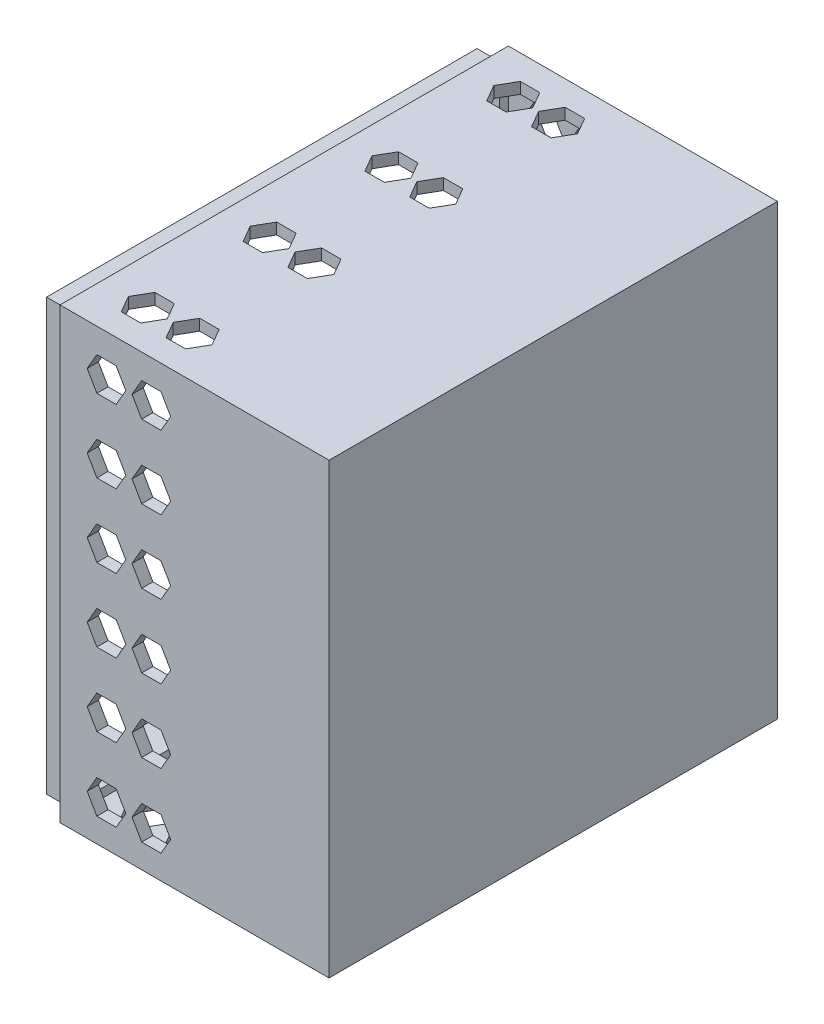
from build123d import *

# Parameters (mm, degrees)
SKETCH1_W           = 33.02
SKETCH1_H           = 50.8
BOSS_EXTRUDE1_DEPTH = 50.8
SKETCH2_W           = 50.8
SKETCH2_H           = 50.8
SKETCH2_W_2         = 48.768
SKETCH2_H_2         = 48.768
CUT_EXTRUDE1_DEPTH  = 2.54
SHELL1_T            = -1.27
CUT_EXTRUDE2_REACH  = 88.472
CUT_EXTRUDE3_REACH  = 88.472


with BuildPart() as part:
    # Sketch1 → Boss-Extrude1 (new body)
    with BuildSketch(Plane.XY):
        with Locations((-31.616315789, 25.4)):
            Rectangle(SKETCH1_W, SKETCH1_H)
    extrude(amount=BOSS_EXTRUDE1_DEPTH)

    # Sketch2 → Cut-Extrude1 (cut)
    with BuildSketch(Plane.ZY.offset(48.126315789)):
        with Locations((25.4, 25.4)):
            Rectangle(SKETCH2_W, SKETCH2_H)
        with Locations((25.4, 25.4)):
            Rectangle(SKETCH2_W_2, SKETCH2_H_2, mode=Mode.SUBTRACT)
    extrude(amount=-CUT_EXTRUDE1_DEPTH, mode=Mode.SUBTRACT)

    # Shell1
    shell1_openings = [part.faces().sort_by_distance(p)[0] for p in [
        (-48.126315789, 25.4, 25.4),
    ]]
    offset(amount=SHELL1_T, openings=shell1_openings, kind=Kind.INTERSECTION)

    # Cut-Extrude2: up to this face of the body (flat: up to its plane)
    cut_extrude2_end = Plane(part.part.faces().sort_by_distance((-30.346315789, 25.4, 50.8))[0])
    # Sketch3 → Cut-Extrude2 (cut, up to the picked face)
    with BuildSketch(Plane(origin=(0, 0, 0), x_dir=(-1, 0, 0), z_dir=(0, 0, -1)), mode=Mode.PRIVATE) as cut_extrude2_sk1:
        Polygon((37.425683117, 4.620876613), (36.331625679, 6.515839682), (34.143510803, 6.515839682), (33.049453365, 4.620876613), (34.143510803, 2.725913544), (36.331625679, 2.725913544), align=None)
    cut_extrude2_tool1 = split(extrude(cut_extrude2_sk1.sketch, amount=-CUT_EXTRUDE2_REACH, mode=Mode.PRIVATE), bisect_by=cut_extrude2_end, keep=Keep.BOTH, mode=Mode.PRIVATE)
    # Sketch3 → Cut-Extrude2 (cut, up to the picked face)
    with BuildSketch(Plane(origin=(0, 0, 0), x_dir=(-1, 0, 0), z_dir=(0, 0, -1)), mode=Mode.PRIVATE) as cut_extrude2_sk2:
        Polygon((42.505683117, 4.620876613), (41.411625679, 6.515839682), (39.223510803, 6.515839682), (38.129453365, 4.620876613), (39.223510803, 2.725913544), (41.411625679, 2.725913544), align=None)
    cut_extrude2_tool2 = split(extrude(cut_extrude2_sk2.sketch, amount=-CUT_EXTRUDE2_REACH, mode=Mode.PRIVATE), bisect_by=cut_extrude2_end, keep=Keep.BOTH, mode=Mode.PRIVATE)
    # Sketch3 → Cut-Extrude2 (cut, up to the picked face)
    with BuildSketch(Plane(origin=(0, 0, 0), x_dir=(-1, 0, 0), z_dir=(0, 0, -1)), mode=Mode.PRIVATE) as cut_extrude2_sk3:
        Polygon((37.425683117, 12.918908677), (36.331625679, 14.813871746), (34.143510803, 14.813871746), (33.049453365, 12.918908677), (34.143510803, 11.023945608), (36.331625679, 11.023945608), align=None)
    cut_extrude2_tool3 = split(extrude(cut_extrude2_sk3.sketch, amount=-CUT_EXTRUDE2_REACH, mode=Mode.PRIVATE), bisect_by=cut_extrude2_end, keep=Keep.BOTH, mode=Mode.PRIVATE)
    # Sketch3 → Cut-Extrude2 (cut, up to the picked face)
    with BuildSketch(Plane(origin=(0, 0, 0), x_dir=(-1, 0, 0), z_dir=(0, 0, -1)), mode=Mode.PRIVATE) as cut_extrude2_sk4:
        Polygon((37.425683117, 21.21694074), (36.331625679, 23.111903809), (34.143510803, 23.111903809), (33.049453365, 21.21694074), (34.143510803, 19.321977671), (36.331625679, 19.321977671), align=None)
    cut_extrude2_tool4 = split(extrude(cut_extrude2_sk4.sketch, amount=-CUT_EXTRUDE2_REACH, mode=Mode.PRIVATE), bisect_by=cut_extrude2_end, keep=Keep.BOTH, mode=Mode.PRIVATE)
    # Sketch3 → Cut-Extrude2 (cut, up to the picked face)
    with BuildSketch(Plane(origin=(0, 0, 0), x_dir=(-1, 0, 0), z_dir=(0, 0, -1)), mode=Mode.PRIVATE) as cut_extrude2_sk5:
        Polygon((37.425683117, 29.514972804), (36.331625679, 31.409935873), (34.143510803, 31.409935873), (33.049453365, 29.514972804), (34.143510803, 27.620009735), (36.331625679, 27.620009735), align=None)
    cut_extrude2_tool5 = split(extrude(cut_extrude2_sk5.sketch, amount=-CUT_EXTRUDE2_REACH, mode=Mode.PRIVATE), bisect_by=cut_extrude2_end, keep=Keep.BOTH, mode=Mode.PRIVATE)
    # Sketch3 → Cut-Extrude2 (cut, up to the picked face)
    with BuildSketch(Plane(origin=(0, 0, 0), x_dir=(-1, 0, 0), z_dir=(0, 0, -1)), mode=Mode.PRIVATE) as cut_extrude2_sk6:
        Polygon((37.425683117, 37.813004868), (36.331625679, 39.707967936), (34.143510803, 39.707967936), (33.049453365, 37.813004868), (34.143510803, 35.918041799), (36.331625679, 35.918041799), align=None)
    cut_extrude2_tool6 = split(extrude(cut_extrude2_sk6.sketch, amount=-CUT_EXTRUDE2_REACH, mode=Mode.PRIVATE), bisect_by=cut_extrude2_end, keep=Keep.BOTH, mode=Mode.PRIVATE)
    # Sketch3 → Cut-Extrude2 (cut, up to the picked face)
    with BuildSketch(Plane(origin=(0, 0, 0), x_dir=(-1, 0, 0), z_dir=(0, 0, -1)), mode=Mode.PRIVATE) as cut_extrude2_sk7:
        Polygon((37.425683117, 46.111036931), (36.331625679, 48.006), (34.143510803, 48.006), (33.049453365, 46.111036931), (34.143510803, 44.216073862), (36.331625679, 44.216073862), align=None)
    cut_extrude2_tool7 = split(extrude(cut_extrude2_sk7.sketch, amount=-CUT_EXTRUDE2_REACH, mode=Mode.PRIVATE), bisect_by=cut_extrude2_end, keep=Keep.BOTH, mode=Mode.PRIVATE)
    # Sketch3 → Cut-Extrude2 (cut, up to the picked face)
    with BuildSketch(Plane(origin=(0, 0, 0), x_dir=(-1, 0, 0), z_dir=(0, 0, -1)), mode=Mode.PRIVATE) as cut_extrude2_sk8:
        Polygon((42.505683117, 12.918908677), (41.411625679, 14.813871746), (39.223510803, 14.813871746), (38.129453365, 12.918908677), (39.223510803, 11.023945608), (41.411625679, 11.023945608), align=None)
    cut_extrude2_tool8 = split(extrude(cut_extrude2_sk8.sketch, amount=-CUT_EXTRUDE2_REACH, mode=Mode.PRIVATE), bisect_by=cut_extrude2_end, keep=Keep.BOTH, mode=Mode.PRIVATE)
    # Sketch3 → Cut-Extrude2 (cut, up to the picked face)
    with BuildSketch(Plane(origin=(0, 0, 0), x_dir=(-1, 0, 0), z_dir=(0, 0, -1)), mode=Mode.PRIVATE) as cut_extrude2_sk9:
        Polygon((42.505683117, 21.21694074), (41.411625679, 23.111903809), (39.223510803, 23.111903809), (38.129453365, 21.21694074), (39.223510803, 19.321977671), (41.411625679, 19.321977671), align=None)
    cut_extrude2_tool9 = split(extrude(cut_extrude2_sk9.sketch, amount=-CUT_EXTRUDE2_REACH, mode=Mode.PRIVATE), bisect_by=cut_extrude2_end, keep=Keep.BOTH, mode=Mode.PRIVATE)
    # Sketch3 → Cut-Extrude2 (cut, up to the picked face)
    with BuildSketch(Plane(origin=(0, 0, 0), x_dir=(-1, 0, 0), z_dir=(0, 0, -1)), mode=Mode.PRIVATE) as cut_extrude2_sk10:
        Polygon((42.505683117, 29.514972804), (41.411625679, 31.409935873), (39.223510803, 31.409935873), (38.129453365, 29.514972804), (39.223510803, 27.620009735), (41.411625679, 27.620009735), align=None)
    cut_extrude2_tool10 = split(extrude(cut_extrude2_sk10.sketch, amount=-CUT_EXTRUDE2_REACH, mode=Mode.PRIVATE), bisect_by=cut_extrude2_end, keep=Keep.BOTH, mode=Mode.PRIVATE)
    # Sketch3 → Cut-Extrude2 (cut, up to the picked face)
    with BuildSketch(Plane(origin=(0, 0, 0), x_dir=(-1, 0, 0), z_dir=(0, 0, -1)), mode=Mode.PRIVATE) as cut_extrude2_sk11:
        Polygon((42.505683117, 37.813004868), (41.411625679, 39.707967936), (39.223510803, 39.707967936), (38.129453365, 37.813004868), (39.223510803, 35.918041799), (41.411625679, 35.918041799), align=None)
    cut_extrude2_tool11 = split(extrude(cut_extrude2_sk11.sketch, amount=-CUT_EXTRUDE2_REACH, mode=Mode.PRIVATE), bisect_by=cut_extrude2_end, keep=Keep.BOTH, mode=Mode.PRIVATE)
    # Sketch3 → Cut-Extrude2 (cut, up to the picked face)
    with BuildSketch(Plane(origin=(0, 0, 0), x_dir=(-1, 0, 0), z_dir=(0, 0, -1)), mode=Mode.PRIVATE) as cut_extrude2_sk12:
        Polygon((42.505683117, 46.111036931), (41.411625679, 48.006), (39.223510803, 48.006), (38.129453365, 46.111036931), (39.223510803, 44.216073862), (41.411625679, 44.216073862), align=None)
    cut_extrude2_tool12 = split(extrude(cut_extrude2_sk12.sketch, amount=-CUT_EXTRUDE2_REACH, mode=Mode.PRIVATE), bisect_by=cut_extrude2_end, keep=Keep.BOTH, mode=Mode.PRIVATE)
    add(cut_extrude2_tool1.solids().sort_by(Axis((-35.237568, 4.620877, 0), (0, 0, 1)))[0], mode=Mode.SUBTRACT)
    add(cut_extrude2_tool2.solids().sort_by(Axis((-40.317568, 4.620877, 0), (0, 0, 1)))[0], mode=Mode.SUBTRACT)
    add(cut_extrude2_tool3.solids().sort_by(Axis((-35.237568, 12.918909, 0), (0, 0, 1)))[0], mode=Mode.SUBTRACT)
    add(cut_extrude2_tool4.solids().sort_by(Axis((-35.237568, 21.216941, 0), (0, 0, 1)))[0], mode=Mode.SUBTRACT)
    add(cut_extrude2_tool5.solids().sort_by(Axis((-35.237568, 29.514973, 0), (0, 0, 1)))[0], mode=Mode.SUBTRACT)
    add(cut_extrude2_tool6.solids().sort_by(Axis((-35.237568, 37.813005, 0), (0, 0, 1)))[0], mode=Mode.SUBTRACT)
    add(cut_extrude2_tool7.solids().sort_by(Axis((-35.237568, 46.111037, 0), (0, 0, 1)))[0], mode=Mode.SUBTRACT)
    add(cut_extrude2_tool8.solids().sort_by(Axis((-40.317568, 12.918909, 0), (0, 0, 1)))[0], mode=Mode.SUBTRACT)
    add(cut_extrude2_tool9.solids().sort_by(Axis((-40.317568, 21.216941, 0), (0, 0, 1)))[0], mode=Mode.SUBTRACT)
    add(cut_extrude2_tool10.solids().sort_by(Axis((-40.317568, 29.514973, 0), (0, 0, 1)))[0], mode=Mode.SUBTRACT)
    add(cut_extrude2_tool11.solids().sort_by(Axis((-40.317568, 37.813005, 0), (0, 0, 1)))[0], mode=Mode.SUBTRACT)
    add(cut_extrude2_tool12.solids().sort_by(Axis((-40.317568, 46.111037, 0), (0, 0, 1)))[0], mode=Mode.SUBTRACT)

    # Cut-Extrude3: up to this face of the body (flat: up to its plane)
    cut_extrude3_end = Plane(part.part.faces().sort_by_distance((-30.346315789, 50.8, 25.4))[0])
    # Sketch4 → Cut-Extrude3 (cut, up to the picked face)
    with BuildSketch(Plane.XZ, mode=Mode.PRIVATE) as cut_extrude3_sk1:
        Polygon((-33.058906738, 46.101), (-34.158759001, 48.006), (-36.358463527, 48.006), (-37.458315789, 46.101), (-36.358463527, 44.196), (-34.158759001, 44.196), align=None)
    cut_extrude3_tool1 = split(extrude(cut_extrude3_sk1.sketch, amount=-CUT_EXTRUDE3_REACH, mode=Mode.PRIVATE), bisect_by=cut_extrude3_end, keep=Keep.BOTH, mode=Mode.PRIVATE)
    # Sketch4 → Cut-Extrude3 (cut, up to the picked face)
    with BuildSketch(Plane.XZ, mode=Mode.PRIVATE) as cut_extrude3_sk2:
        Polygon((-38.138906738, 46.101), (-39.238759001, 48.006), (-41.438463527, 48.006), (-42.538315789, 46.101), (-41.438463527, 44.196), (-39.238759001, 44.196), align=None)
    cut_extrude3_tool2 = split(extrude(cut_extrude3_sk2.sketch, amount=-CUT_EXTRUDE3_REACH, mode=Mode.PRIVATE), bisect_by=cut_extrude3_end, keep=Keep.BOTH, mode=Mode.PRIVATE)
    # Sketch4 → Cut-Extrude3 (cut, up to the picked face)
    with BuildSketch(Plane.XZ, mode=Mode.PRIVATE) as cut_extrude3_sk3:
        Polygon((-33.058906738, 32.300333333), (-34.158759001, 34.205333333), (-36.358463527, 34.205333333), (-37.458315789, 32.300333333), (-36.358463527, 30.395333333), (-34.158759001, 30.395333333), align=None)
    cut_extrude3_tool3 = split(extrude(cut_extrude3_sk3.sketch, amount=-CUT_EXTRUDE3_REACH, mode=Mode.PRIVATE), bisect_by=cut_extrude3_end, keep=Keep.BOTH, mode=Mode.PRIVATE)
    # Sketch4 → Cut-Extrude3 (cut, up to the picked face)
    with BuildSketch(Plane.XZ, mode=Mode.PRIVATE) as cut_extrude3_sk4:
        Polygon((-33.058906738, 18.499666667), (-34.158759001, 20.404666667), (-36.358463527, 20.404666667), (-37.458315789, 18.499666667), (-36.358463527, 16.594666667), (-34.158759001, 16.594666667), align=None)
    cut_extrude3_tool4 = split(extrude(cut_extrude3_sk4.sketch, amount=-CUT_EXTRUDE3_REACH, mode=Mode.PRIVATE), bisect_by=cut_extrude3_end, keep=Keep.BOTH, mode=Mode.PRIVATE)
    # Sketch4 → Cut-Extrude3 (cut, up to the picked face)
    with BuildSketch(Plane.XZ, mode=Mode.PRIVATE) as cut_extrude3_sk5:
        Polygon((-33.058906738, 4.699), (-34.158759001, 6.604), (-36.358463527, 6.604), (-37.458315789, 4.699), (-36.358463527, 2.794), (-34.158759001, 2.794), align=None)
    cut_extrude3_tool5 = split(extrude(cut_extrude3_sk5.sketch, amount=-CUT_EXTRUDE3_REACH, mode=Mode.PRIVATE), bisect_by=cut_extrude3_end, keep=Keep.BOTH, mode=Mode.PRIVATE)
    # Sketch4 → Cut-Extrude3 (cut, up to the picked face)
    with BuildSketch(Plane.XZ, mode=Mode.PRIVATE) as cut_extrude3_sk6:
        Polygon((-38.138906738, 32.300333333), (-39.238759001, 34.205333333), (-41.438463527, 34.205333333), (-42.538315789, 32.300333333), (-41.438463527, 30.395333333), (-39.238759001, 30.395333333), align=None)
    cut_extrude3_tool6 = split(extrude(cut_extrude3_sk6.sketch, amount=-CUT_EXTRUDE3_REACH, mode=Mode.PRIVATE), bisect_by=cut_extrude3_end, keep=Keep.BOTH, mode=Mode.PRIVATE)
    # Sketch4 → Cut-Extrude3 (cut, up to the picked face)
    with BuildSketch(Plane.XZ, mode=Mode.PRIVATE) as cut_extrude3_sk7:
        Polygon((-38.138906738, 18.499666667), (-39.238759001, 20.404666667), (-41.438463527, 20.404666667), (-42.538315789, 18.499666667), (-41.438463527, 16.594666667), (-39.238759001, 16.594666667), align=None)
    cut_extrude3_tool7 = split(extrude(cut_extrude3_sk7.sketch, amount=-CUT_EXTRUDE3_REACH, mode=Mode.PRIVATE), bisect_by=cut_extrude3_end, keep=Keep.BOTH, mode=Mode.PRIVATE)
    # Sketch4 → Cut-Extrude3 (cut, up to the picked face)
    with BuildSketch(Plane.XZ, mode=Mode.PRIVATE) as cut_extrude3_sk8:
        Polygon((-38.138906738, 4.699), (-39.238759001, 6.604), (-41.438463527, 6.604), (-42.538315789, 4.699), (-41.438463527, 2.794), (-39.238759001, 2.794), align=None)
    cut_extrude3_tool8 = split(extrude(cut_extrude3_sk8.sketch, amount=-CUT_EXTRUDE3_REACH, mode=Mode.PRIVATE), bisect_by=cut_extrude3_end, keep=Keep.BOTH, mode=Mode.PRIVATE)
    add(cut_extrude3_tool1.solids().sort_by(Axis((-35.258611, 0, 46.101), (0, 1, 0)))[0], mode=Mode.SUBTRACT)
    add(cut_extrude3_tool2.solids().sort_by(Axis((-40.338611, 0, 46.101), (0, 1, 0)))[0], mode=Mode.SUBTRACT)
    add(cut_extrude3_tool3.solids().sort_by(Axis((-35.258611, 0, 32.300333), (0, 1, 0)))[0], mode=Mode.SUBTRACT)
    add(cut_extrude3_tool4.solids().sort_by(Axis((-35.258611, 0, 18.499667), (0, 1, 0)))[0], mode=Mode.SUBTRACT)
    add(cut_extrude3_tool5.solids().sort_by(Axis((-35.258611, 0, 4.699), (0, 1, 0)))[0], mode=Mode.SUBTRACT)
    add(cut_extrude3_tool6.solids().sort_by(Axis((-40.338611, 0, 32.300333), (0, 1, 0)))[0], mode=Mode.SUBTRACT)
    add(cut_extrude3_tool7.solids().sort_by(Axis((-40.338611, 0, 18.499667), (0, 1, 0)))[0], mode=Mode.SUBTRACT)
    add(cut_extrude3_tool8.solids().sort_by(Axis((-40.338611, 0, 4.699), (0, 1, 0)))[0], mode=Mode.SUBTRACT)


solid = part.part
